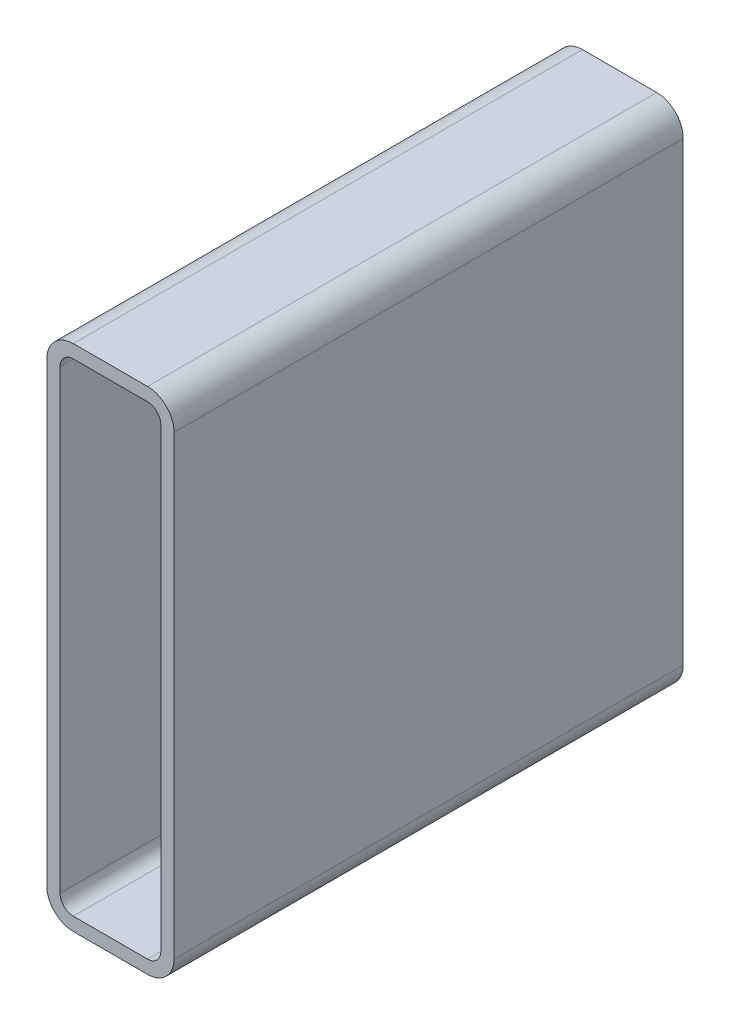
ISO-10303-21;
HEADER;
FILE_DESCRIPTION(('STEP AP214'),'2;1');
FILE_NAME('part.step','',(''),(''),'','','');
FILE_SCHEMA(('AUTOMOTIVE_DESIGN { 1 0 10303 214 1 1 1 1 }'));
ENDSEC;
DATA;
#1=APPLICATION_CONTEXT('core data for automotive mechanical design processes');
#2=APPLICATION_PROTOCOL_DEFINITION('international standard','automotive_design',2000,#1);
#3=PRODUCT_CONTEXT('',#1,'mechanical');
#4=PRODUCT('Part','Part','',(#3));
#5=PRODUCT_RELATED_PRODUCT_CATEGORY('part','',(#4));
#6=PRODUCT_DEFINITION_FORMATION('','',#4);
#7=PRODUCT_DEFINITION_CONTEXT('part definition',#1,'design');
#8=PRODUCT_DEFINITION('design','',#6,#7);
#9=PRODUCT_DEFINITION_SHAPE('','',#8);
#10=(LENGTH_UNIT() NAMED_UNIT(*) SI_UNIT(.MILLI.,.METRE.));
#11=(NAMED_UNIT(*) PLANE_ANGLE_UNIT() SI_UNIT($,.RADIAN.));
#12=(NAMED_UNIT(*) SI_UNIT($,.STERADIAN.) SOLID_ANGLE_UNIT());
#13=UNCERTAINTY_MEASURE_WITH_UNIT(LENGTH_MEASURE(1.E-05),#10,'distance_accuracy_value','');
#14=(GEOMETRIC_REPRESENTATION_CONTEXT(3) GLOBAL_UNCERTAINTY_ASSIGNED_CONTEXT((#13)) GLOBAL_UNIT_ASSIGNED_CONTEXT((#10,
#11,#12)) REPRESENTATION_CONTEXT('',''));
#15=CARTESIAN_POINT('',(0.,0.,0.));
#16=DIRECTION('',(0.,0.,1.));
#17=DIRECTION('',(1.,0.,0.));
#18=AXIS2_PLACEMENT_3D('',#15,#16,#17);
#19=CARTESIAN_POINT('',(18.3641160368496,290.799496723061,304.8));
#20=DIRECTION('',(0.,0.,1.));
#21=DIRECTION('',(1.,0.,0.));
#22=AXIS2_PLACEMENT_3D('',#19,#20,#21);
#23=PLANE('',#22);
#24=CARTESIAN_POINT('',(18.3641160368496,290.799496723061,304.8));
#25=DIRECTION('',(0.,0.,1.));
#26=DIRECTION('',(1.,0.,0.));
#27=AXIS2_PLACEMENT_3D('',#24,#25,#26);
#28=CIRCLE('',#27,15.875);
#29=CARTESIAN_POINT('',(18.3641160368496,306.674496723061,304.8));
#30=VERTEX_POINT('',#29);
#31=CARTESIAN_POINT('',(2.48911603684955,290.799496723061,304.8));
#32=VERTEX_POINT('',#31);
#33=EDGE_CURVE('E211',#30,#32,#28,.T.);
#34=ORIENTED_EDGE('',*,*,#33,.T.);
#35=DIRECTION('',(0.,-1.,0.));
#36=VECTOR('',#35,1.);
#37=CARTESIAN_POINT('',(2.48911603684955,17.7494967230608,304.8));
#38=LINE('',#37,#36);
#39=CARTESIAN_POINT('',(2.48911603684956,17.7494967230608,304.8));
#40=VERTEX_POINT('',#39);
#41=EDGE_CURVE('E214',#32,#40,#38,.T.);
#42=ORIENTED_EDGE('',*,*,#41,.T.);
#43=CARTESIAN_POINT('',(18.3641160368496,17.7494967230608,304.8));
#44=DIRECTION('',(0.,0.,1.));
#45=DIRECTION('',(1.,0.,0.));
#46=AXIS2_PLACEMENT_3D('',#43,#44,#45);
#47=CIRCLE('',#46,15.875);
#48=CARTESIAN_POINT('',(18.3641160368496,1.87449672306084,304.8));
#49=VERTEX_POINT('',#48);
#50=EDGE_CURVE('E217',#40,#49,#47,.T.);
#51=ORIENTED_EDGE('',*,*,#50,.T.);
#52=DIRECTION('',(1.,0.,0.));
#53=VECTOR('',#52,1.);
#54=CARTESIAN_POINT('',(62.8141160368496,1.87449672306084,304.8));
#55=LINE('',#54,#53);
#56=CARTESIAN_POINT('',(62.8141160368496,1.87449672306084,304.8));
#57=VERTEX_POINT('',#56);
#58=EDGE_CURVE('E219',#49,#57,#55,.T.);
#59=ORIENTED_EDGE('',*,*,#58,.T.);
#60=CARTESIAN_POINT('',(62.8141160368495,17.7494967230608,304.8));
#61=DIRECTION('',(0.,0.,1.));
#62=DIRECTION('',(1.,0.,0.));
#63=AXIS2_PLACEMENT_3D('',#60,#61,#62);
#64=CIRCLE('',#63,15.875);
#65=CARTESIAN_POINT('',(78.6891160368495,17.7494967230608,304.8));
#66=VERTEX_POINT('',#65);
#67=EDGE_CURVE('E221',#57,#66,#64,.T.);
#68=ORIENTED_EDGE('',*,*,#67,.T.);
#69=DIRECTION('',(0.,1.,0.));
#70=VECTOR('',#69,1.);
#71=CARTESIAN_POINT('',(78.6891160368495,290.799496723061,304.8));
#72=LINE('',#71,#70);
#73=CARTESIAN_POINT('',(78.6891160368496,290.799496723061,304.8));
#74=VERTEX_POINT('',#73);
#75=EDGE_CURVE('E223',#66,#74,#72,.T.);
#76=ORIENTED_EDGE('',*,*,#75,.T.);
#77=CARTESIAN_POINT('',(62.8141160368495,290.799496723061,304.8));
#78=DIRECTION('',(0.,0.,1.));
#79=DIRECTION('',(1.,0.,0.));
#80=AXIS2_PLACEMENT_3D('',#77,#78,#79);
#81=CIRCLE('',#80,15.875);
#82=CARTESIAN_POINT('',(62.8141160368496,306.674496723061,304.8));
#83=VERTEX_POINT('',#82);
#84=EDGE_CURVE('E225',#74,#83,#81,.T.);
#85=ORIENTED_EDGE('',*,*,#84,.T.);
#86=DIRECTION('',(-1.,0.,0.));
#87=VECTOR('',#86,1.);
#88=CARTESIAN_POINT('',(18.3641160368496,306.674496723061,304.8));
#89=LINE('',#88,#87);
#90=EDGE_CURVE('E227',#83,#30,#89,.T.);
#91=ORIENTED_EDGE('',*,*,#90,.T.);
#92=EDGE_LOOP('',(#34,#42,#51,#59,#68,#76,#85,#91));
#93=FACE_BOUND('',#92,.T.);
#94=DIRECTION('',(0.,-1.,0.));
#95=VECTOR('',#94,1.);
#96=CARTESIAN_POINT('',(10.4266160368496,17.7494967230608,304.8));
#97=LINE('',#96,#95);
#98=CARTESIAN_POINT('',(10.4266160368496,290.799496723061,304.8));
#99=VERTEX_POINT('',#98);
#100=CARTESIAN_POINT('',(10.4266160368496,17.7494967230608,304.8));
#101=VERTEX_POINT('',#100);
#102=EDGE_CURVE('E154',#99,#101,#97,.T.);
#103=ORIENTED_EDGE('',*,*,#102,.F.);
#104=CARTESIAN_POINT('',(18.3641160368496,290.799496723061,304.8));
#105=DIRECTION('',(0.,0.,1.));
#106=DIRECTION('',(1.,0.,0.));
#107=AXIS2_PLACEMENT_3D('',#104,#105,#106);
#108=CIRCLE('',#107,7.9375);
#109=CARTESIAN_POINT('',(18.3641160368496,298.736996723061,304.8));
#110=VERTEX_POINT('',#109);
#111=EDGE_CURVE('E146',#110,#99,#108,.T.);
#112=ORIENTED_EDGE('',*,*,#111,.F.);
#113=DIRECTION('',(-1.,0.,0.));
#114=VECTOR('',#113,1.);
#115=CARTESIAN_POINT('',(18.3641160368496,298.736996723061,304.8));
#116=LINE('',#115,#114);
#117=CARTESIAN_POINT('',(62.8141160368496,298.736996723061,304.8));
#118=VERTEX_POINT('',#117);
#119=EDGE_CURVE('E179',#118,#110,#116,.T.);
#120=ORIENTED_EDGE('',*,*,#119,.F.);
#121=CARTESIAN_POINT('',(62.8141160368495,290.799496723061,304.8));
#122=DIRECTION('',(0.,0.,1.));
#123=DIRECTION('',(1.,0.,0.));
#124=AXIS2_PLACEMENT_3D('',#121,#122,#123);
#125=CIRCLE('',#124,7.9375);
#126=CARTESIAN_POINT('',(70.7516160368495,290.799496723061,304.8));
#127=VERTEX_POINT('',#126);
#128=EDGE_CURVE('E177',#127,#118,#125,.T.);
#129=ORIENTED_EDGE('',*,*,#128,.F.);
#130=DIRECTION('',(0.,1.,0.));
#131=VECTOR('',#130,1.);
#132=CARTESIAN_POINT('',(70.7516160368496,290.799496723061,304.8));
#133=LINE('',#132,#131);
#134=CARTESIAN_POINT('',(70.7516160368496,17.7494967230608,304.8));
#135=VERTEX_POINT('',#134);
#136=EDGE_CURVE('E175',#135,#127,#133,.T.);
#137=ORIENTED_EDGE('',*,*,#136,.F.);
#138=CARTESIAN_POINT('',(62.8141160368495,17.7494967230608,304.8));
#139=DIRECTION('',(0.,0.,1.));
#140=DIRECTION('',(1.,0.,0.));
#141=AXIS2_PLACEMENT_3D('',#138,#139,#140);
#142=CIRCLE('',#141,7.93750000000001);
#143=CARTESIAN_POINT('',(62.8141160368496,9.81199672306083,304.8));
#144=VERTEX_POINT('',#143);
#145=EDGE_CURVE('E173',#144,#135,#142,.T.);
#146=ORIENTED_EDGE('',*,*,#145,.F.);
#147=DIRECTION('',(1.,0.,0.));
#148=VECTOR('',#147,1.);
#149=CARTESIAN_POINT('',(62.8141160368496,9.81199672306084,304.8));
#150=LINE('',#149,#148);
#151=CARTESIAN_POINT('',(18.3641160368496,9.81199672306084,304.8));
#152=VERTEX_POINT('',#151);
#153=EDGE_CURVE('E169',#152,#144,#150,.T.);
#154=ORIENTED_EDGE('',*,*,#153,.F.);
#155=CARTESIAN_POINT('',(18.3641160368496,17.7494967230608,304.8));
#156=DIRECTION('',(0.,0.,1.));
#157=DIRECTION('',(1.,0.,0.));
#158=AXIS2_PLACEMENT_3D('',#155,#156,#157);
#159=CIRCLE('',#158,7.9375);
#160=EDGE_CURVE('E167',#101,#152,#159,.T.);
#161=ORIENTED_EDGE('',*,*,#160,.F.);
#162=EDGE_LOOP('',(#103,#112,#120,#129,#137,#146,#154,#161));
#163=FACE_BOUND('',#162,.T.);
#164=ADVANCED_FACE('F33',(#93,#163),#23,.T.);
#165=CARTESIAN_POINT('',(18.3641160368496,290.799496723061,0.));
#166=DIRECTION('',(0.,0.,1.));
#167=DIRECTION('',(1.,0.,0.));
#168=AXIS2_PLACEMENT_3D('',#165,#166,#167);
#169=PLANE('',#168);
#170=CARTESIAN_POINT('',(18.3641160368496,290.799496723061,0.));
#171=DIRECTION('',(0.,0.,1.));
#172=DIRECTION('',(1.,0.,0.));
#173=AXIS2_PLACEMENT_3D('',#170,#171,#172);
#174=CIRCLE('',#173,15.875);
#175=CARTESIAN_POINT('',(18.3641160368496,306.674496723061,0.));
#176=VERTEX_POINT('',#175);
#177=CARTESIAN_POINT('',(2.48911603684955,290.799496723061,0.));
#178=VERTEX_POINT('',#177);
#179=EDGE_CURVE('E162',#176,#178,#174,.T.);
#180=ORIENTED_EDGE('',*,*,#179,.F.);
#181=DIRECTION('',(-1.,0.,0.));
#182=VECTOR('',#181,1.);
#183=CARTESIAN_POINT('',(18.3641160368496,306.674496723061,0.));
#184=LINE('',#183,#182);
#185=CARTESIAN_POINT('',(62.8141160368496,306.674496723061,0.));
#186=VERTEX_POINT('',#185);
#187=EDGE_CURVE('E215',#186,#176,#184,.T.);
#188=ORIENTED_EDGE('',*,*,#187,.F.);
#189=CARTESIAN_POINT('',(62.8141160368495,290.799496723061,0.));
#190=DIRECTION('',(0.,0.,1.));
#191=DIRECTION('',(1.,0.,0.));
#192=AXIS2_PLACEMENT_3D('',#189,#190,#191);
#193=CIRCLE('',#192,15.875);
#194=CARTESIAN_POINT('',(78.6891160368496,290.799496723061,0.));
#195=VERTEX_POINT('',#194);
#196=EDGE_CURVE('E242',#195,#186,#193,.T.);
#197=ORIENTED_EDGE('',*,*,#196,.F.);
#198=DIRECTION('',(0.,1.,0.));
#199=VECTOR('',#198,1.);
#200=CARTESIAN_POINT('',(78.6891160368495,290.799496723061,0.));
#201=LINE('',#200,#199);
#202=CARTESIAN_POINT('',(78.6891160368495,17.7494967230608,0.));
#203=VERTEX_POINT('',#202);
#204=EDGE_CURVE('E240',#203,#195,#201,.T.);
#205=ORIENTED_EDGE('',*,*,#204,.F.);
#206=CARTESIAN_POINT('',(62.8141160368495,17.7494967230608,0.));
#207=DIRECTION('',(0.,0.,1.));
#208=DIRECTION('',(1.,0.,0.));
#209=AXIS2_PLACEMENT_3D('',#206,#207,#208);
#210=CIRCLE('',#209,15.875);
#211=CARTESIAN_POINT('',(62.8141160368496,1.87449672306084,0.));
#212=VERTEX_POINT('',#211);
#213=EDGE_CURVE('E238',#212,#203,#210,.T.);
#214=ORIENTED_EDGE('',*,*,#213,.F.);
#215=DIRECTION('',(1.,0.,0.));
#216=VECTOR('',#215,1.);
#217=CARTESIAN_POINT('',(62.8141160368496,1.87449672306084,0.));
#218=LINE('',#217,#216);
#219=CARTESIAN_POINT('',(18.3641160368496,1.87449672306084,0.));
#220=VERTEX_POINT('',#219);
#221=EDGE_CURVE('E236',#220,#212,#218,.T.);
#222=ORIENTED_EDGE('',*,*,#221,.F.);
#223=CARTESIAN_POINT('',(18.3641160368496,17.7494967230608,0.));
#224=DIRECTION('',(0.,0.,1.));
#225=DIRECTION('',(1.,0.,0.));
#226=AXIS2_PLACEMENT_3D('',#223,#224,#225);
#227=CIRCLE('',#226,15.875);
#228=CARTESIAN_POINT('',(2.48911603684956,17.7494967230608,0.));
#229=VERTEX_POINT('',#228);
#230=EDGE_CURVE('E234',#229,#220,#227,.T.);
#231=ORIENTED_EDGE('',*,*,#230,.F.);
#232=DIRECTION('',(0.,-1.,0.));
#233=VECTOR('',#232,1.);
#234=CARTESIAN_POINT('',(2.48911603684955,17.7494967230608,0.));
#235=LINE('',#234,#233);
#236=EDGE_CURVE('E232',#178,#229,#235,.T.);
#237=ORIENTED_EDGE('',*,*,#236,.F.);
#238=EDGE_LOOP('',(#180,#188,#197,#205,#214,#222,#231,#237));
#239=FACE_BOUND('',#238,.T.);
#240=CARTESIAN_POINT('',(18.3641160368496,290.799496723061,0.));
#241=DIRECTION('',(0.,0.,1.));
#242=DIRECTION('',(1.,0.,0.));
#243=AXIS2_PLACEMENT_3D('',#240,#241,#242);
#244=CIRCLE('',#243,7.9375);
#245=CARTESIAN_POINT('',(18.3641160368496,298.736996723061,0.));
#246=VERTEX_POINT('',#245);
#247=CARTESIAN_POINT('',(10.4266160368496,290.799496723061,0.));
#248=VERTEX_POINT('',#247);
#249=EDGE_CURVE('E56',#246,#248,#244,.T.);
#250=ORIENTED_EDGE('',*,*,#249,.T.);
#251=DIRECTION('',(0.,-1.,0.));
#252=VECTOR('',#251,1.);
#253=CARTESIAN_POINT('',(10.4266160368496,17.7494967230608,0.));
#254=LINE('',#253,#252);
#255=CARTESIAN_POINT('',(10.4266160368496,17.7494967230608,0.));
#256=VERTEX_POINT('',#255);
#257=EDGE_CURVE('E161',#248,#256,#254,.T.);
#258=ORIENTED_EDGE('',*,*,#257,.T.);
#259=CARTESIAN_POINT('',(18.3641160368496,17.7494967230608,0.));
#260=DIRECTION('',(0.,0.,1.));
#261=DIRECTION('',(1.,0.,0.));
#262=AXIS2_PLACEMENT_3D('',#259,#260,#261);
#263=CIRCLE('',#262,7.9375);
#264=CARTESIAN_POINT('',(18.3641160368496,9.81199672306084,0.));
#265=VERTEX_POINT('',#264);
#266=EDGE_CURVE('E183',#256,#265,#263,.T.);
#267=ORIENTED_EDGE('',*,*,#266,.T.);
#268=DIRECTION('',(1.,0.,0.));
#269=VECTOR('',#268,1.);
#270=CARTESIAN_POINT('',(62.8141160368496,9.81199672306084,0.));
#271=LINE('',#270,#269);
#272=CARTESIAN_POINT('',(62.8141160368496,9.81199672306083,0.));
#273=VERTEX_POINT('',#272);
#274=EDGE_CURVE('E186',#265,#273,#271,.T.);
#275=ORIENTED_EDGE('',*,*,#274,.T.);
#276=CARTESIAN_POINT('',(62.8141160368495,17.7494967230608,0.));
#277=DIRECTION('',(0.,0.,1.));
#278=DIRECTION('',(1.,0.,0.));
#279=AXIS2_PLACEMENT_3D('',#276,#277,#278);
#280=CIRCLE('',#279,7.93750000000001);
#281=CARTESIAN_POINT('',(70.7516160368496,17.7494967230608,0.));
#282=VERTEX_POINT('',#281);
#283=EDGE_CURVE('E189',#273,#282,#280,.T.);
#284=ORIENTED_EDGE('',*,*,#283,.T.);
#285=DIRECTION('',(0.,1.,0.));
#286=VECTOR('',#285,1.);
#287=CARTESIAN_POINT('',(70.7516160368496,290.799496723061,0.));
#288=LINE('',#287,#286);
#289=CARTESIAN_POINT('',(70.7516160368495,290.799496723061,0.));
#290=VERTEX_POINT('',#289);
#291=EDGE_CURVE('E192',#282,#290,#288,.T.);
#292=ORIENTED_EDGE('',*,*,#291,.T.);
#293=CARTESIAN_POINT('',(62.8141160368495,290.799496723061,0.));
#294=DIRECTION('',(0.,0.,1.));
#295=DIRECTION('',(1.,0.,0.));
#296=AXIS2_PLACEMENT_3D('',#293,#294,#295);
#297=CIRCLE('',#296,7.9375);
#298=CARTESIAN_POINT('',(62.8141160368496,298.736996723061,0.));
#299=VERTEX_POINT('',#298);
#300=EDGE_CURVE('E195',#290,#299,#297,.T.);
#301=ORIENTED_EDGE('',*,*,#300,.T.);
#302=DIRECTION('',(-1.,0.,0.));
#303=VECTOR('',#302,1.);
#304=CARTESIAN_POINT('',(18.3641160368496,298.736996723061,0.));
#305=LINE('',#304,#303);
#306=EDGE_CURVE('E155',#299,#246,#305,.T.);
#307=ORIENTED_EDGE('',*,*,#306,.T.);
#308=EDGE_LOOP('',(#250,#258,#267,#275,#284,#292,#301,#307));
#309=FACE_BOUND('',#308,.T.);
#310=ADVANCED_FACE('F272',(#239,#309),#169,.F.);
#311=CARTESIAN_POINT('',(18.3641160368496,290.799496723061,304.8));
#312=DIRECTION('',(0.,0.,-1.));
#313=DIRECTION('',(-1.,0.,0.));
#314=AXIS2_PLACEMENT_3D('',#311,#312,#313);
#315=CYLINDRICAL_SURFACE('',#314,15.875);
#316=ORIENTED_EDGE('',*,*,#179,.T.);
#317=DIRECTION('',(0.,0.,-1.));
#318=VECTOR('',#317,1.);
#319=CARTESIAN_POINT('',(2.48911603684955,290.799496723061,304.8));
#320=LINE('',#319,#318);
#321=EDGE_CURVE('E11',#32,#178,#320,.T.);
#322=ORIENTED_EDGE('',*,*,#321,.F.);
#323=ORIENTED_EDGE('',*,*,#33,.F.);
#324=DIRECTION('',(0.,0.,-1.));
#325=VECTOR('',#324,1.);
#326=CARTESIAN_POINT('',(18.3641160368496,306.674496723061,304.8));
#327=LINE('',#326,#325);
#328=EDGE_CURVE('E229',#30,#176,#327,.T.);
#329=ORIENTED_EDGE('',*,*,#328,.T.);
#330=EDGE_LOOP('',(#316,#322,#323,#329));
#331=FACE_BOUND('',#330,.T.);
#332=ADVANCED_FACE('F35',(#331),#315,.T.);
#333=CARTESIAN_POINT('',(2.48911603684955,17.7494967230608,304.8));
#334=DIRECTION('',(1.,0.,0.));
#335=DIRECTION('',(0.,0.,-1.));
#336=AXIS2_PLACEMENT_3D('',#333,#334,#335);
#337=PLANE('',#336);
#338=ORIENTED_EDGE('',*,*,#236,.T.);
#339=DIRECTION('',(0.,0.,-1.));
#340=VECTOR('',#339,1.);
#341=CARTESIAN_POINT('',(2.48911603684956,17.7494967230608,304.8));
#342=LINE('',#341,#340);
#343=EDGE_CURVE('E41',#40,#229,#342,.T.);
#344=ORIENTED_EDGE('',*,*,#343,.F.);
#345=ORIENTED_EDGE('',*,*,#41,.F.);
#346=ORIENTED_EDGE('',*,*,#321,.T.);
#347=EDGE_LOOP('',(#338,#344,#345,#346));
#348=FACE_BOUND('',#347,.T.);
#349=ADVANCED_FACE('F289',(#348),#337,.F.);
#350=CARTESIAN_POINT('',(18.3641160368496,17.7494967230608,304.8));
#351=DIRECTION('',(0.,0.,-1.));
#352=DIRECTION('',(-1.,0.,0.));
#353=AXIS2_PLACEMENT_3D('',#350,#351,#352);
#354=CYLINDRICAL_SURFACE('',#353,15.875);
#355=ORIENTED_EDGE('',*,*,#230,.T.);
#356=DIRECTION('',(0.,0.,-1.));
#357=VECTOR('',#356,1.);
#358=CARTESIAN_POINT('',(18.3641160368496,1.87449672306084,304.8));
#359=LINE('',#358,#357);
#360=EDGE_CURVE('E259',#49,#220,#359,.T.);
#361=ORIENTED_EDGE('',*,*,#360,.F.);
#362=ORIENTED_EDGE('',*,*,#50,.F.);
#363=ORIENTED_EDGE('',*,*,#343,.T.);
#364=EDGE_LOOP('',(#355,#361,#362,#363));
#365=FACE_BOUND('',#364,.T.);
#366=ADVANCED_FACE('F266',(#365),#354,.T.);
#367=CARTESIAN_POINT('',(62.8141160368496,1.87449672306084,304.8));
#368=DIRECTION('',(0.,1.,0.));
#369=DIRECTION('',(0.,0.,1.));
#370=AXIS2_PLACEMENT_3D('',#367,#368,#369);
#371=PLANE('',#370);
#372=ORIENTED_EDGE('',*,*,#221,.T.);
#373=DIRECTION('',(0.,0.,-1.));
#374=VECTOR('',#373,1.);
#375=CARTESIAN_POINT('',(62.8141160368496,1.87449672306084,304.8));
#376=LINE('',#375,#374);
#377=EDGE_CURVE('E256',#57,#212,#376,.T.);
#378=ORIENTED_EDGE('',*,*,#377,.F.);
#379=ORIENTED_EDGE('',*,*,#58,.F.);
#380=ORIENTED_EDGE('',*,*,#360,.T.);
#381=EDGE_LOOP('',(#372,#378,#379,#380));
#382=FACE_BOUND('',#381,.T.);
#383=ADVANCED_FACE('F278',(#382),#371,.F.);
#384=CARTESIAN_POINT('',(62.8141160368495,17.7494967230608,304.8));
#385=DIRECTION('',(0.,0.,-1.));
#386=DIRECTION('',(-1.,0.,0.));
#387=AXIS2_PLACEMENT_3D('',#384,#385,#386);
#388=CYLINDRICAL_SURFACE('',#387,15.875);
#389=ORIENTED_EDGE('',*,*,#213,.T.);
#390=DIRECTION('',(0.,0.,-1.));
#391=VECTOR('',#390,1.);
#392=CARTESIAN_POINT('',(78.6891160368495,17.7494967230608,304.8));
#393=LINE('',#392,#391);
#394=EDGE_CURVE('E253',#66,#203,#393,.T.);
#395=ORIENTED_EDGE('',*,*,#394,.F.);
#396=ORIENTED_EDGE('',*,*,#67,.F.);
#397=ORIENTED_EDGE('',*,*,#377,.T.);
#398=EDGE_LOOP('',(#389,#395,#396,#397));
#399=FACE_BOUND('',#398,.T.);
#400=ADVANCED_FACE('F282',(#399),#388,.T.);
#401=CARTESIAN_POINT('',(78.6891160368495,290.799496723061,304.8));
#402=DIRECTION('',(-1.,0.,0.));
#403=DIRECTION('',(0.,0.,1.));
#404=AXIS2_PLACEMENT_3D('',#401,#402,#403);
#405=PLANE('',#404);
#406=ORIENTED_EDGE('',*,*,#204,.T.);
#407=DIRECTION('',(0.,0.,-1.));
#408=VECTOR('',#407,1.);
#409=CARTESIAN_POINT('',(78.6891160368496,290.799496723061,304.8));
#410=LINE('',#409,#408);
#411=EDGE_CURVE('E250',#74,#195,#410,.T.);
#412=ORIENTED_EDGE('',*,*,#411,.F.);
#413=ORIENTED_EDGE('',*,*,#75,.F.);
#414=ORIENTED_EDGE('',*,*,#394,.T.);
#415=EDGE_LOOP('',(#406,#412,#413,#414));
#416=FACE_BOUND('',#415,.T.);
#417=ADVANCED_FACE('F302',(#416),#405,.F.);
#418=CARTESIAN_POINT('',(62.8141160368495,290.799496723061,304.8));
#419=DIRECTION('',(0.,0.,-1.));
#420=DIRECTION('',(-1.,0.,0.));
#421=AXIS2_PLACEMENT_3D('',#418,#419,#420);
#422=CYLINDRICAL_SURFACE('',#421,15.875);
#423=ORIENTED_EDGE('',*,*,#196,.T.);
#424=DIRECTION('',(0.,0.,-1.));
#425=VECTOR('',#424,1.);
#426=CARTESIAN_POINT('',(62.8141160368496,306.674496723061,304.8));
#427=LINE('',#426,#425);
#428=EDGE_CURVE('E247',#83,#186,#427,.T.);
#429=ORIENTED_EDGE('',*,*,#428,.F.);
#430=ORIENTED_EDGE('',*,*,#84,.F.);
#431=ORIENTED_EDGE('',*,*,#411,.T.);
#432=EDGE_LOOP('',(#423,#429,#430,#431));
#433=FACE_BOUND('',#432,.T.);
#434=ADVANCED_FACE('F300',(#433),#422,.T.);
#435=CARTESIAN_POINT('',(18.3641160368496,306.674496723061,304.8));
#436=DIRECTION('',(0.,-1.,0.));
#437=DIRECTION('',(0.,0.,-1.));
#438=AXIS2_PLACEMENT_3D('',#435,#436,#437);
#439=PLANE('',#438);
#440=ORIENTED_EDGE('',*,*,#187,.T.);
#441=ORIENTED_EDGE('',*,*,#328,.F.);
#442=ORIENTED_EDGE('',*,*,#90,.F.);
#443=ORIENTED_EDGE('',*,*,#428,.T.);
#444=EDGE_LOOP('',(#440,#441,#442,#443));
#445=FACE_BOUND('',#444,.T.);
#446=ADVANCED_FACE('F295',(#445),#439,.F.);
#447=CARTESIAN_POINT('',(18.3641160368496,290.799496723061,304.8));
#448=DIRECTION('',(0.,0.,-1.));
#449=DIRECTION('',(-1.,0.,0.));
#450=AXIS2_PLACEMENT_3D('',#447,#448,#449);
#451=CYLINDRICAL_SURFACE('',#450,7.9375);
#452=ORIENTED_EDGE('',*,*,#249,.F.);
#453=DIRECTION('',(0.,0.,-1.));
#454=VECTOR('',#453,1.);
#455=CARTESIAN_POINT('',(18.3641160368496,298.736996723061,304.8));
#456=LINE('',#455,#454);
#457=EDGE_CURVE('E150',#110,#246,#456,.T.);
#458=ORIENTED_EDGE('',*,*,#457,.F.);
#459=ORIENTED_EDGE('',*,*,#111,.T.);
#460=DIRECTION('',(0.,0.,-1.));
#461=VECTOR('',#460,1.);
#462=CARTESIAN_POINT('',(10.4266160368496,290.799496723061,304.8));
#463=LINE('',#462,#461);
#464=EDGE_CURVE('E149',#99,#248,#463,.T.);
#465=ORIENTED_EDGE('',*,*,#464,.T.);
#466=EDGE_LOOP('',(#452,#458,#459,#465));
#467=FACE_BOUND('',#466,.T.);
#468=ADVANCED_FACE('F148',(#467),#451,.F.);
#469=CARTESIAN_POINT('',(10.4266160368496,17.7494967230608,304.8));
#470=DIRECTION('',(1.,0.,0.));
#471=DIRECTION('',(0.,0.,-1.));
#472=AXIS2_PLACEMENT_3D('',#469,#470,#471);
#473=PLANE('',#472);
#474=ORIENTED_EDGE('',*,*,#257,.F.);
#475=ORIENTED_EDGE('',*,*,#464,.F.);
#476=ORIENTED_EDGE('',*,*,#102,.T.);
#477=DIRECTION('',(0.,0.,-1.));
#478=VECTOR('',#477,1.);
#479=CARTESIAN_POINT('',(10.4266160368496,17.7494967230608,304.8));
#480=LINE('',#479,#478);
#481=EDGE_CURVE('E163',#101,#256,#480,.T.);
#482=ORIENTED_EDGE('',*,*,#481,.T.);
#483=EDGE_LOOP('',(#474,#475,#476,#482));
#484=FACE_BOUND('',#483,.T.);
#485=ADVANCED_FACE('F158',(#484),#473,.T.);
#486=CARTESIAN_POINT('',(18.3641160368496,17.7494967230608,304.8));
#487=DIRECTION('',(0.,0.,-1.));
#488=DIRECTION('',(-1.,0.,0.));
#489=AXIS2_PLACEMENT_3D('',#486,#487,#488);
#490=CYLINDRICAL_SURFACE('',#489,7.9375);
#491=ORIENTED_EDGE('',*,*,#266,.F.);
#492=ORIENTED_EDGE('',*,*,#481,.F.);
#493=ORIENTED_EDGE('',*,*,#160,.T.);
#494=DIRECTION('',(0.,0.,-1.));
#495=VECTOR('',#494,1.);
#496=CARTESIAN_POINT('',(18.3641160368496,9.81199672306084,304.8));
#497=LINE('',#496,#495);
#498=EDGE_CURVE('E208',#152,#265,#497,.T.);
#499=ORIENTED_EDGE('',*,*,#498,.T.);
#500=EDGE_LOOP('',(#491,#492,#493,#499));
#501=FACE_BOUND('',#500,.T.);
#502=ADVANCED_FACE('F327',(#501),#490,.F.);
#503=CARTESIAN_POINT('',(62.8141160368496,9.81199672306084,304.8));
#504=DIRECTION('',(0.,1.,0.));
#505=DIRECTION('',(0.,0.,1.));
#506=AXIS2_PLACEMENT_3D('',#503,#504,#505);
#507=PLANE('',#506);
#508=ORIENTED_EDGE('',*,*,#274,.F.);
#509=ORIENTED_EDGE('',*,*,#498,.F.);
#510=ORIENTED_EDGE('',*,*,#153,.T.);
#511=DIRECTION('',(0.,0.,-1.));
#512=VECTOR('',#511,1.);
#513=CARTESIAN_POINT('',(62.8141160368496,9.81199672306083,304.8));
#514=LINE('',#513,#512);
#515=EDGE_CURVE('E206',#144,#273,#514,.T.);
#516=ORIENTED_EDGE('',*,*,#515,.T.);
#517=EDGE_LOOP('',(#508,#509,#510,#516));
#518=FACE_BOUND('',#517,.T.);
#519=ADVANCED_FACE('F331',(#518),#507,.T.);
#520=CARTESIAN_POINT('',(62.8141160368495,17.7494967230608,304.8));
#521=DIRECTION('',(0.,0.,-1.));
#522=DIRECTION('',(-1.,0.,0.));
#523=AXIS2_PLACEMENT_3D('',#520,#521,#522);
#524=CYLINDRICAL_SURFACE('',#523,7.93750000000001);
#525=ORIENTED_EDGE('',*,*,#283,.F.);
#526=ORIENTED_EDGE('',*,*,#515,.F.);
#527=ORIENTED_EDGE('',*,*,#145,.T.);
#528=DIRECTION('',(0.,0.,-1.));
#529=VECTOR('',#528,1.);
#530=CARTESIAN_POINT('',(70.7516160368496,17.7494967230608,304.8));
#531=LINE('',#530,#529);
#532=EDGE_CURVE('E204',#135,#282,#531,.T.);
#533=ORIENTED_EDGE('',*,*,#532,.T.);
#534=EDGE_LOOP('',(#525,#526,#527,#533));
#535=FACE_BOUND('',#534,.T.);
#536=ADVANCED_FACE('F337',(#535),#524,.F.);
#537=CARTESIAN_POINT('',(70.7516160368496,290.799496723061,304.8));
#538=DIRECTION('',(-1.,0.,0.));
#539=DIRECTION('',(0.,0.,1.));
#540=AXIS2_PLACEMENT_3D('',#537,#538,#539);
#541=PLANE('',#540);
#542=ORIENTED_EDGE('',*,*,#291,.F.);
#543=ORIENTED_EDGE('',*,*,#532,.F.);
#544=ORIENTED_EDGE('',*,*,#136,.T.);
#545=DIRECTION('',(0.,0.,-1.));
#546=VECTOR('',#545,1.);
#547=CARTESIAN_POINT('',(70.7516160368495,290.799496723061,304.8));
#548=LINE('',#547,#546);
#549=EDGE_CURVE('E202',#127,#290,#548,.T.);
#550=ORIENTED_EDGE('',*,*,#549,.T.);
#551=EDGE_LOOP('',(#542,#543,#544,#550));
#552=FACE_BOUND('',#551,.T.);
#553=ADVANCED_FACE('F341',(#552),#541,.T.);
#554=CARTESIAN_POINT('',(62.8141160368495,290.799496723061,304.8));
#555=DIRECTION('',(0.,0.,-1.));
#556=DIRECTION('',(-1.,0.,0.));
#557=AXIS2_PLACEMENT_3D('',#554,#555,#556);
#558=CYLINDRICAL_SURFACE('',#557,7.9375);
#559=ORIENTED_EDGE('',*,*,#300,.F.);
#560=ORIENTED_EDGE('',*,*,#549,.F.);
#561=ORIENTED_EDGE('',*,*,#128,.T.);
#562=DIRECTION('',(0.,0.,-1.));
#563=VECTOR('',#562,1.);
#564=CARTESIAN_POINT('',(62.8141160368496,298.736996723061,304.8));
#565=LINE('',#564,#563);
#566=EDGE_CURVE('E48',#118,#299,#565,.T.);
#567=ORIENTED_EDGE('',*,*,#566,.T.);
#568=EDGE_LOOP('',(#559,#560,#561,#567));
#569=FACE_BOUND('',#568,.T.);
#570=ADVANCED_FACE('F345',(#569),#558,.F.);
#571=CARTESIAN_POINT('',(18.3641160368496,298.736996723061,304.8));
#572=DIRECTION('',(0.,-1.,0.));
#573=DIRECTION('',(0.,0.,-1.));
#574=AXIS2_PLACEMENT_3D('',#571,#572,#573);
#575=PLANE('',#574);
#576=ORIENTED_EDGE('',*,*,#306,.F.);
#577=ORIENTED_EDGE('',*,*,#566,.F.);
#578=ORIENTED_EDGE('',*,*,#119,.T.);
#579=ORIENTED_EDGE('',*,*,#457,.T.);
#580=EDGE_LOOP('',(#576,#577,#578,#579));
#581=FACE_BOUND('',#580,.T.);
#582=ADVANCED_FACE('F349',(#581),#575,.T.);
#583=CLOSED_SHELL('',(#164,#310,#332,#349,#366,#383,#400,#417,#434,#446,#468,#485,#502,#519,
#536,#553,#570,#582));
#584=MANIFOLD_SOLID_BREP('B2',#583);
#585=ADVANCED_BREP_SHAPE_REPRESENTATION('',(#18,#584),#14);
#586=SHAPE_DEFINITION_REPRESENTATION(#9,#585);
ENDSEC;
END-ISO-10303-21;
